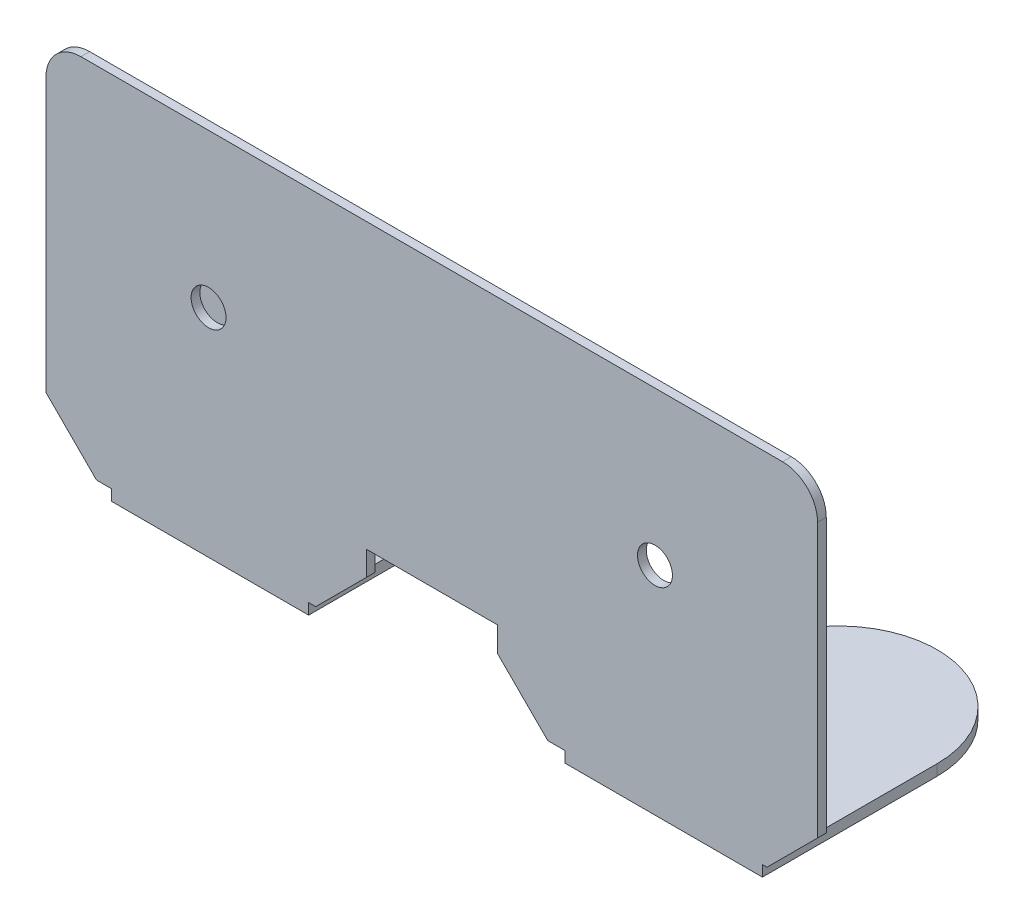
from build123d import *

# Parameters (mm, degrees)
ESQUISSE1_R      = 0.4
EXTRUSION1_DEPTH = 0.2
ESQUISSE2_R      = 1.950512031
EXTRUSION2_DEPTH = 0.3
EXTRUSION2_TAPER = 45
EXTRUSION3_DEPTH = 0.25


with BuildPart() as part:
    # Esquisse1 → Extrusion1 (new body)
    with BuildSketch(Plane.XY):
        with BuildLine():
            Line((9.879843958, -0.562534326), (8.722843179, -1.719535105))
            Line((8.722843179, -1.719535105), (3.702751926, -1.719535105))
            Line((3.702751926, -1.719535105), (2.545751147, -0.562534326))
            Line((2.545751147, -0.562534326), (2.545751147, 0))
            Line((2.545751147, 0), (-0.454248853, 0))
            Line((-0.454248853, 0), (-0.454248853, -0.562534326))
            Line((-0.454248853, -0.562534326), (-1.611249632, -1.719535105))
            Line((-1.611249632, -1.719535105), (-6.631340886, -1.719535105))
            Line((-6.631340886, -1.719535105), (-7.788341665, -0.562534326))
            Line((-7.788341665, -0.562534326), (-7.788341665, 5.7))
            ThreePointArc((-7.788341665, 5.7), (-7.55402709, 6.265685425), (-6.988341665, 6.5))
            Line((-6.988341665, 6.5), (9.079843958, 6.5))
            ThreePointArc((9.079843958, 6.5), (9.645529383, 6.265685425), (9.879843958, 5.7))
            Line((9.879843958, 5.7), (9.879843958, -0.562534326))
        make_face()
        with Locations((6.157301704, 2.985169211)):
            Circle(ESQUISSE1_R, mode=Mode.SUBTRACT)
        with Locations((-4.065799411, 2.985169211)):
            Circle(ESQUISSE1_R, mode=Mode.SUBTRACT)
    extrude(amount=EXTRUSION1_DEPTH)

    # Esquisse2 → Extrusion2 (add)
    with BuildSketch(Plane(origin=(0, 0, 0), x_dir=(-1, 0, 0), z_dir=(0, 0, -1))):
        with Locations((4.065799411, 2.985169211)):
            Circle(ESQUISSE2_R)
    extrude(amount=EXTRUSION2_DEPTH, taper=EXTRUSION2_TAPER)

    # Esquisse3 → Extrusion3 (add)
    with BuildSketch(Plane.XZ.offset(1.719535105)):
        with BuildLine():
            Line((8.617979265, 0.2), (8.617979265, -3.800824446))
            ThreePointArc((8.617979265, -3.800824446), (6.355645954, -6.063157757), (4.093312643, -3.800824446))
            Line((4.093312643, -3.800824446), (4.093312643, 0.2))
            Line((4.093312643, 0.2), (8.617979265, 0.2))
        make_face()
        with BuildLine():
            Line((-1.773234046, 0.2), (-6.293972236, 0.2))
            Line((-6.293972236, 0.2), (-6.293972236, -3.800824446))
            ThreePointArc((-6.293972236, -3.800824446), (-4.033603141, -6.061193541), (-1.773234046, -3.800824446))
            Line((-1.773234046, -3.800824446), (-1.773234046, 0.2))
        make_face()
    extrude(amount=EXTRUSION3_DEPTH)


solid = part.part
